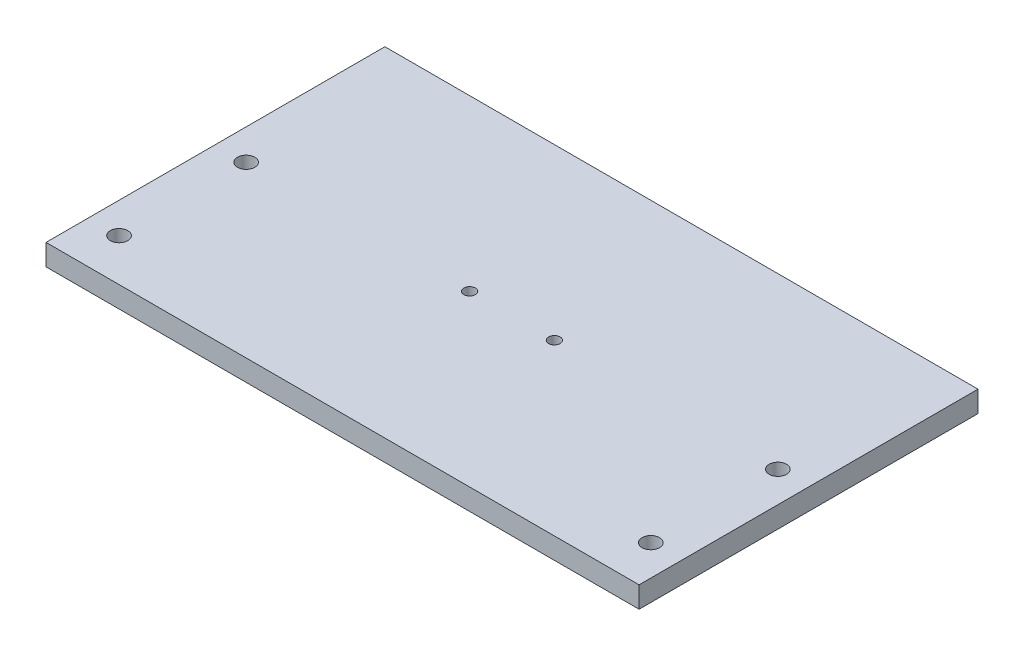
from build123d import *

# Parameters (mm, degrees)
SKETCH1_W          = 101.6
SKETCH1_H          = 6.35
EXTRUDE1_DEPTH     = 177.8
SKETCH3_R          = 1.7272
SKETCH3_R_2        = 2.6162
CUT_EXTRUDE1_DEPTH = 205.879775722


with BuildPart() as part:
    # Sketch1 → Extrude1 (new body)
    with BuildSketch(Plane(origin=(0, 0, 0), x_dir=(0, 0, -1), z_dir=(1, 0, 0))):
        with Locations((50.8, -3.175)):
            Rectangle(SKETCH1_W, SKETCH1_H)
    extrude(amount=EXTRUDE1_DEPTH)

    # Sketch3 → Cut-Extrude1 (cut, through all)
    with BuildSketch(Plane(origin=(0, 0, 0), x_dir=(-1, 0, 0), z_dir=(0, 1, 0))):
        with Locations(Location((-76.2, -50.8, 0), (0, 0, 90))):
            Circle(SKETCH3_R)
        with Locations(Location((-101.6, -50.8, 0), (0, 0, 90))):
            Circle(SKETCH3_R)
        with Locations(Location((-168.6052, -50.8, 0), (0, 0, 90))):
            Circle(SKETCH3_R_2)
        with Locations(Location((-168.6052, -12.7, 0), (0, 0, 90))):
            Circle(SKETCH3_R_2)
        with Locations(Location((-9.1948, -12.7, 0), (0, 0, 90))):
            Circle(SKETCH3_R_2)
        with Locations(Location((-9.1948, -50.8, 0), (0, 0, 90))):
            Circle(SKETCH3_R_2)
    extrude(amount=-CUT_EXTRUDE1_DEPTH, mode=Mode.SUBTRACT)


solid = part.part
